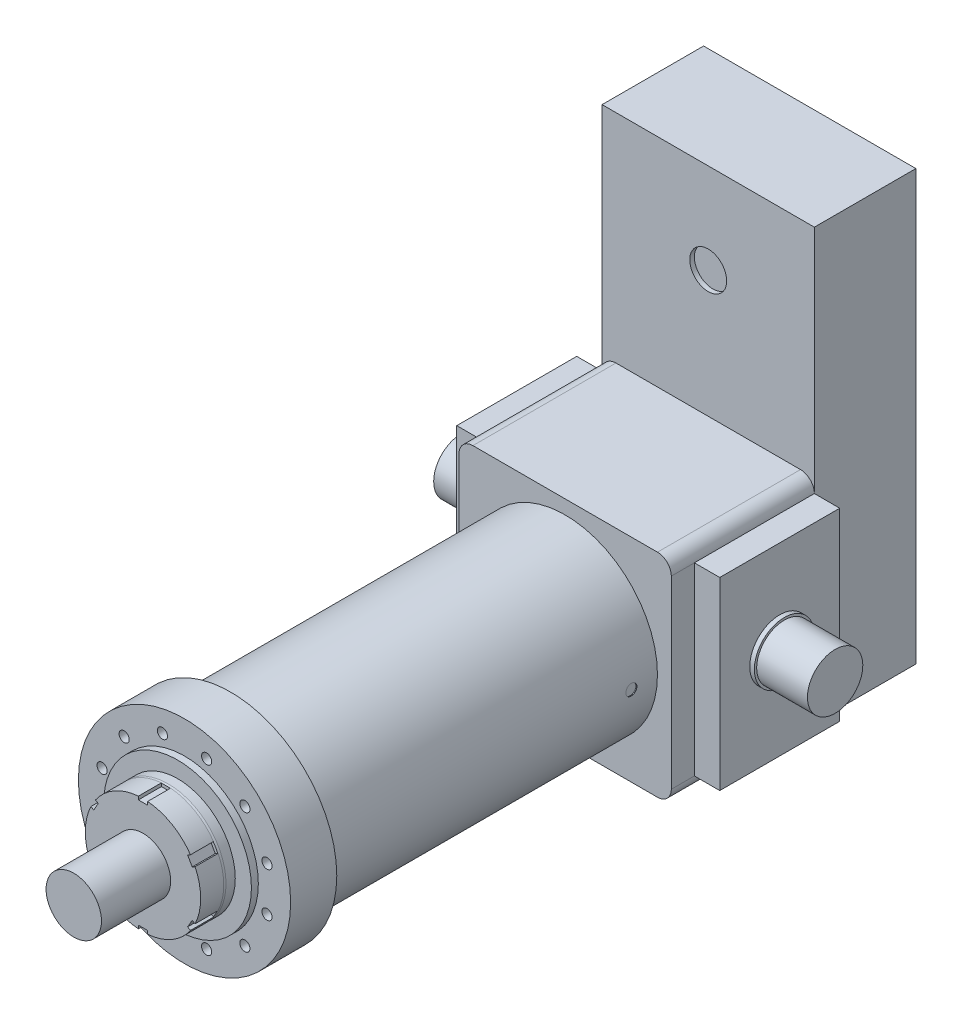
from build123d import *

# Parameters (mm, degrees)
SKETCH_1_R          = 200
EXTRUDE_1_DEPTH     = 725
SKETCH_2_R          = 230
SKETCH_2_R_2        = 11
EXTRUDE_2_DEPTH     = 100
SKETCH_3_R          = 160
EXTRUDE_3_DEPTH     = 15
SKETCH_4_R          = 125
EXTRUDE_4_DEPTH     = 25
CHAMFER_1_SIZE      = 5
CHAMFER_1_SIZE2     = 0.881634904
SKETCH_6_W          = 460
SKETCH_6_H          = 460
EXTRUDE_6_DEPTH     = 310
SKETCH_9_R          = 12
CUT_EXTRUDE_2_DEPTH = 2
SKETCH_10_R         = 12
CUT_EXTRUDE_3_DEPTH = 2
EXTRUDE_7_DEPTH     = 50
SKETCH_11_R         = 60
EXTRUDE_8_DEPTH     = 150
SKETCH_12_W         = 460
SKETCH_12_H         = 930
EXTRUDE_9_DEPTH     = 220
SKETCH_13_R         = 40
CUT_EXTRUDE_5_DEPTH = 10
FILLET_1_R          = 30
SKETCH_16_W         = 260
SKETCH_16_H         = 400
EXTRUDE_12_DEPTH    = 55
EXTRUDE_START       = -460
SKETCH_16_2_W       = 260
SKETCH_16_2_H       = 400
EXTRUDE_13_DEPTH    = 55
SKETCH_17_R         = 60
EXTRUDE_14_DEPTH    = 120
EXTRUDE_START_2     = -570
SKETCH_17_2_R       = 60
EXTRUDE_15_DEPTH    = 120
SKETCH_18_R         = 65
SKETCH_18_R_2       = 60
EXTRUDE_16_DEPTH    = 10
SKETCH_18_2_R       = 65
SKETCH_18_2_R_2     = 60
EXTRUDE_17_DEPTH    = 10


with BuildPart() as part:
    # Sketch 1 → Extrude 1 (new body)
    with BuildSketch(Plane.XY):
        Circle(SKETCH_1_R)
    extrude(amount=EXTRUDE_1_DEPTH)

    # Sketch 2 → Extrude 2 (add)
    with BuildSketch(Plane.XY.offset(725)):
        Circle(SKETCH_2_R)
        with Locations((178.696277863, 47.881523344)):
            Circle(SKETCH_2_R_2, mode=Mode.SUBTRACT)
        with Locations((178.696277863, -47.881523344)):
            Circle(SKETCH_2_R_2, mode=Mode.SUBTRACT)
        with Locations((130.81475452, -130.81475452)):
            Circle(SKETCH_2_R_2, mode=Mode.SUBTRACT)
        with Locations((47.881523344, -178.696277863)):
            Circle(SKETCH_2_R_2, mode=Mode.SUBTRACT)
        with Locations((-47.881523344, -178.696277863)):
            Circle(SKETCH_2_R_2, mode=Mode.SUBTRACT)
        with Locations((-130.81475452, -130.81475452)):
            Circle(SKETCH_2_R_2, mode=Mode.SUBTRACT)
        with Locations((-178.696277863, -47.881523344)):
            Circle(SKETCH_2_R_2, mode=Mode.SUBTRACT)
        with Locations((-178.696277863, 47.881523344)):
            Circle(SKETCH_2_R_2, mode=Mode.SUBTRACT)
        with Locations((-130.81475452, 130.814754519)):
            Circle(SKETCH_2_R_2, mode=Mode.SUBTRACT)
        with Locations((-47.881523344, 178.696277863)):
            Circle(SKETCH_2_R_2, mode=Mode.SUBTRACT)
        with Locations((47.881523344, 178.696277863)):
            Circle(SKETCH_2_R_2, mode=Mode.SUBTRACT)
        with Locations((130.81475452, 130.81475452)):
            Circle(SKETCH_2_R_2, mode=Mode.SUBTRACT)
    extrude(amount=EXTRUDE_2_DEPTH)

    # Sketch 3 → Extrude 3 (add)
    with BuildSketch(Plane.XY.offset(825)):
        Circle(SKETCH_3_R)
    extrude(amount=EXTRUDE_3_DEPTH)

    # Sketch 4 → Extrude 4 (add)
    with BuildSketch(Plane.XY.offset(840)):
        Circle(SKETCH_4_R)
    extrude(amount=EXTRUDE_4_DEPTH)

    # Chamfer 1
    chamfer_1_edges = [part.edges().sort_by_distance(p)[0] for p in [
        (-125, 0, 865),
    ]]
    chamfer_1_side = [part.faces().sort_by_distance(p)[0] for p in [
        (-125, 0, 852.5),
    ]]
    chamfer(chamfer_1_edges, length=CHAMFER_1_SIZE, length2=CHAMFER_1_SIZE2, reference=chamfer_1_side[0])

    # Sketch 9 → Cut-Extrude 2 (cut)
    with BuildSketch(Plane(origin=(-200, 0, 0), x_dir=(0, 0, -1), z_dir=(1, 0, 0))):
        with Locations(Location((-36.5, 0, 0), (0, 0, 180))):
            Circle(SKETCH_9_R)
        with Locations(Location((-670.5, 0, 0), (0, 0, 180))):
            Circle(SKETCH_9_R)
    extrude(amount=CUT_EXTRUDE_2_DEPTH, mode=Mode.SUBTRACT)

    # Sketch 10 → Cut-Extrude 3 (cut)
    with BuildSketch(Plane(origin=(200, 0, 0), x_dir=(0, 0, -1), z_dir=(1, 0, 0))):
        with Locations((-56.5, 0)):
            Circle(SKETCH_10_R)
    extrude(amount=-CUT_EXTRUDE_3_DEPTH, mode=Mode.SUBTRACT)

    # Sketch 5 → Extrude 7 (add)
    with BuildSketch(Plane.XY.offset(865)):
        with BuildLine():
            Line((-10, 124.599357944), (-10, 117.5))
            Line((-10, 117.5), (10, 117.5))
            Line((10, 117.5), (10, 124.599357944))
            ThreePointArc((10, 124.599357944), (62.5, 108.253175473), (102.906209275, 70.95993301))
            Line((102.906209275, 70.95993301), (96.757984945, 67.410254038))
            Line((96.757984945, 67.410254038), (106.757984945, 50.089745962))
            Line((106.757984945, 50.089745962), (112.906209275, 53.639424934))
            ThreePointArc((112.906209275, 53.639424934), (125, 0), (112.906209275, -53.639424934))
            Line((112.906209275, -53.639424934), (106.757984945, -50.089745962))
            Line((106.757984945, -50.089745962), (96.757984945, -67.410254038))
            Line((96.757984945, -67.410254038), (102.906209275, -70.95993301))
            ThreePointArc((102.906209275, -70.95993301), (62.5, -108.253175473), (10, -124.599357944))
            Line((10, -124.599357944), (10, -117.5))
            Line((10, -117.5), (-10, -117.5))
            Line((-10, -117.5), (-10, -124.599357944))
            ThreePointArc((-10, -124.599357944), (-62.5, -108.253175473), (-102.906209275, -70.95993301))
            Line((-102.906209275, -70.95993301), (-96.757984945, -67.410254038))
            Line((-96.757984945, -67.410254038), (-106.757984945, -50.089745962))
            Line((-106.757984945, -50.089745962), (-112.906209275, -53.639424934))
            ThreePointArc((-112.906209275, -53.639424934), (-125, 0), (-112.906209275, 53.639424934))
            Line((-112.906209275, 53.639424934), (-106.757984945, 50.089745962))
            Line((-106.757984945, 50.089745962), (-96.757984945, 67.410254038))
            Line((-96.757984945, 67.410254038), (-102.906209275, 70.95993301))
            ThreePointArc((-102.906209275, 70.95993301), (-62.5, 108.253175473), (-10, 124.599357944))
        make_face()
    extrude(amount=EXTRUDE_7_DEPTH)

    # Sketch 11 → Extrude 8 (add)
    with BuildSketch(Plane.XY.offset(915)):
        Circle(SKETCH_11_R)
    extrude(amount=EXTRUDE_8_DEPTH)


with BuildPart() as body_2:
    # Sketch 6 → Extrude 6 (new body)
    with BuildSketch(Plane(origin=(0, 0, 0), x_dir=(-1, 0, 0), z_dir=(0, 0, -1))):
        Rectangle(SKETCH_6_W, SKETCH_6_H)
    extrude(amount=EXTRUDE_6_DEPTH)

    # Fillet 1
    fillet_1_edges = [body_2.edges().sort_by_distance(p)[0] for p in [
        (-230, -230, -155),
        (230, -230, -155),
        (230, 230, -155),
        (-230, 230, -155),
    ]]
    fillet(fillet_1_edges, radius=FILLET_1_R)



with BuildPart() as body_3:
    # Sketch 12 → Extrude 9 (new body)
    with BuildSketch(Plane(origin=(0, 0, -310), x_dir=(-1, 0, 0), z_dir=(0, 0, -1))):
        with Locations((0, 235)):
            Rectangle(SKETCH_12_W, SKETCH_12_H)
    extrude(amount=EXTRUDE_9_DEPTH)

    # Sketch 13 → Cut-Extrude 5 (cut)
    with BuildSketch(Plane.XY.offset(-310)):
        with Locations((0, 504)):
            Circle(SKETCH_13_R)
    extrude(amount=-CUT_EXTRUDE_5_DEPTH, mode=Mode.SUBTRACT)


with BuildPart() as body_2_1:
    add(body_2.part)

    add(body_3.part)  # Extrude 12 merges body 3
    # Sketch 16 → Extrude 12 (add)
    with BuildSketch(Plane.ZY.offset(230)):
        with Locations((-180, 0)):
            Rectangle(SKETCH_16_W, SKETCH_16_H)
    extrude(amount=EXTRUDE_12_DEPTH)

    # Sketch 16_2 → Extrude 13 (add)
    with BuildSketch(Plane.ZY.offset(230).offset(EXTRUDE_START)):
        with Locations((-180, 0)):
            Rectangle(SKETCH_16_2_W, SKETCH_16_2_H)
    extrude(amount=-EXTRUDE_13_DEPTH)

    # Sketch 17 → Extrude 14 (add)
    with BuildSketch(Plane.ZY.offset(285)):
        with Locations(Location((-180, 0, 0), (0, 0, 270))):
            Circle(SKETCH_17_R)
    extrude(amount=EXTRUDE_14_DEPTH)

    # Sketch 17_2 → Extrude 15 (add)
    with BuildSketch(Plane.ZY.offset(285).offset(EXTRUDE_START_2)):
        with Locations(Location((-180, 0, 0), (0, 0, 270))):
            Circle(SKETCH_17_2_R)
    extrude(amount=-EXTRUDE_15_DEPTH)

    # Sketch 18 → Extrude 16 (add)
    with BuildSketch(Plane.ZY.offset(285)):
        with Locations(Location((-180, 0, 0), (0, 0, 270))):
            Circle(SKETCH_18_R)
        with Locations(Location((-180, 0, 0), (0, 0, 270))):
            Circle(SKETCH_18_R_2, mode=Mode.SUBTRACT)
    extrude(amount=EXTRUDE_16_DEPTH)

    # Sketch 18_2 → Extrude 17 (add)
    with BuildSketch(Plane.ZY.offset(285).offset(EXTRUDE_START_2)):
        with Locations(Location((-180, 0, 0), (0, 0, 270))):
            Circle(SKETCH_18_2_R)
        with Locations(Location((-180, 0, 0), (0, 0, 270))):
            Circle(SKETCH_18_2_R_2, mode=Mode.SUBTRACT)
    extrude(amount=-EXTRUDE_17_DEPTH)


solid = Compound([part.part, body_2_1.part])
